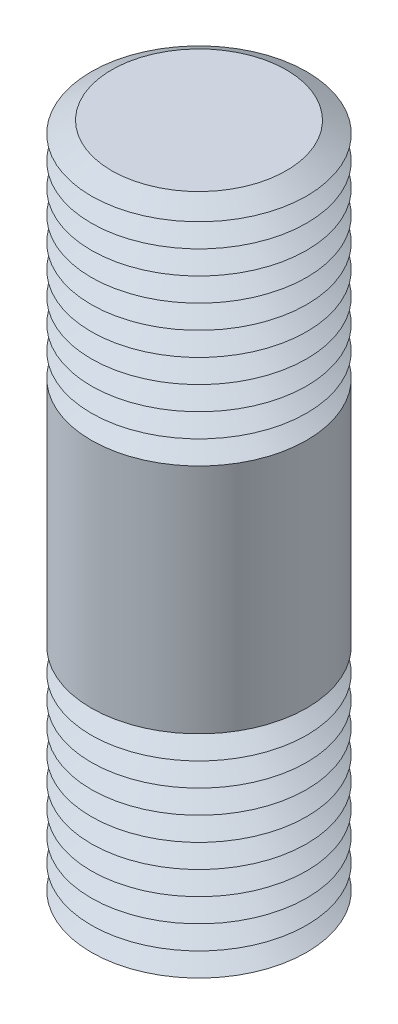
ISO-10303-21;
HEADER;
FILE_DESCRIPTION(('STEP AP214'),'2;1');
FILE_NAME('part.step','',(''),(''),'','','');
FILE_SCHEMA(('AUTOMOTIVE_DESIGN { 1 0 10303 214 1 1 1 1 }'));
ENDSEC;
DATA;
#1=APPLICATION_CONTEXT('core data for automotive mechanical design processes');
#2=APPLICATION_PROTOCOL_DEFINITION('international standard','automotive_design',2000,#1);
#3=PRODUCT_CONTEXT('',#1,'mechanical');
#4=PRODUCT('Part','Part','',(#3));
#5=PRODUCT_RELATED_PRODUCT_CATEGORY('part','',(#4));
#6=PRODUCT_DEFINITION_FORMATION('','',#4);
#7=PRODUCT_DEFINITION_CONTEXT('part definition',#1,'design');
#8=PRODUCT_DEFINITION('design','',#6,#7);
#9=PRODUCT_DEFINITION_SHAPE('','',#8);
#10=(LENGTH_UNIT() NAMED_UNIT(*) SI_UNIT(.MILLI.,.METRE.));
#11=(NAMED_UNIT(*) PLANE_ANGLE_UNIT() SI_UNIT($,.RADIAN.));
#12=(NAMED_UNIT(*) SI_UNIT($,.STERADIAN.) SOLID_ANGLE_UNIT());
#13=UNCERTAINTY_MEASURE_WITH_UNIT(LENGTH_MEASURE(1.E-05),#10,'distance_accuracy_value','');
#14=(GEOMETRIC_REPRESENTATION_CONTEXT(3) GLOBAL_UNCERTAINTY_ASSIGNED_CONTEXT((#13)) GLOBAL_UNIT_ASSIGNED_CONTEXT((#10,
#11,#12)) REPRESENTATION_CONTEXT('',''));
#15=CARTESIAN_POINT('',(0.,0.,0.));
#16=DIRECTION('',(0.,0.,1.));
#17=DIRECTION('',(1.,0.,0.));
#18=AXIS2_PLACEMENT_3D('',#15,#16,#17);
#19=CARTESIAN_POINT('',(0.,-2.96845218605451,0.));
#20=DIRECTION('',(0.,-1.,0.));
#21=DIRECTION('',(0.,0.,-1.));
#22=AXIS2_PLACEMENT_3D('',#19,#20,#21);
#23=CYLINDRICAL_SURFACE('',#22,6.35000000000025);
#24=CARTESIAN_POINT('',(0.,6.8364138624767,0.));
#25=DIRECTION('',(0.,-1.,0.));
#26=DIRECTION('',(0.,0.,-1.));
#27=AXIS2_PLACEMENT_3D('',#24,#25,#26);
#28=CIRCLE('',#27,6.35000000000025);
#29=CARTESIAN_POINT('',(0.,6.8364138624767,-6.35000000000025));
#30=VERTEX_POINT('',#29);
#31=EDGE_CURVE('E10',#30,#30,#28,.T.);
#32=ORIENTED_EDGE('',*,*,#31,.T.);
#33=EDGE_LOOP('',(#32));
#34=FACE_BOUND('',#33,.T.);
#35=CARTESIAN_POINT('',(0.,-6.8364138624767,0.));
#36=DIRECTION('',(0.,-1.,0.));
#37=DIRECTION('',(0.,0.,-1.));
#38=AXIS2_PLACEMENT_3D('',#35,#36,#37);
#39=CIRCLE('',#38,6.35000000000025);
#40=CARTESIAN_POINT('',(0.,-6.8364138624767,-6.35000000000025));
#41=VERTEX_POINT('',#40);
#42=EDGE_CURVE('E98',#41,#41,#39,.T.);
#43=ORIENTED_EDGE('',*,*,#42,.F.);
#44=EDGE_LOOP('',(#43));
#45=FACE_BOUND('',#44,.T.);
#46=ADVANCED_FACE('F31',(#34,#45),#23,.T.);
#47=CARTESIAN_POINT('',(0.,6.8364138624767,0.));
#48=DIRECTION('',(0.,-1.,0.));
#49=DIRECTION('',(0.,0.,-1.));
#50=AXIS2_PLACEMENT_3D('',#47,#48,#49);
#51=CONICAL_SURFACE('',#50,6.35000000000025,1.04719755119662);
#52=CARTESIAN_POINT('',(0.,7.5292341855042,0.));
#53=DIRECTION('',(0.,-1.,0.));
#54=DIRECTION('',(0.,0.,-1.));
#55=AXIS2_PLACEMENT_3D('',#52,#53,#54);
#56=CIRCLE('',#55,5.15000000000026);
#57=CARTESIAN_POINT('',(0.,7.5292341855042,-5.15000000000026));
#58=VERTEX_POINT('',#57);
#59=EDGE_CURVE('E37',#58,#58,#56,.T.);
#60=ORIENTED_EDGE('',*,*,#59,.T.);
#61=EDGE_LOOP('',(#60));
#62=FACE_BOUND('',#61,.T.);
#63=ORIENTED_EDGE('',*,*,#31,.F.);
#64=EDGE_LOOP('',(#63));
#65=FACE_BOUND('',#64,.T.);
#66=ADVANCED_FACE('F277',(#62,#65),#51,.T.);
#67=CARTESIAN_POINT('',(0.,7.5292341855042,0.));
#68=DIRECTION('',(0.,1.,0.));
#69=DIRECTION('',(0.,0.,1.));
#70=AXIS2_PLACEMENT_3D('',#67,#68,#69);
#71=CONICAL_SURFACE('',#70,5.15000000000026,1.04719755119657);
#72=CARTESIAN_POINT('',(0.,8.22205450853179,0.));
#73=DIRECTION('',(0.,-1.,0.));
#74=DIRECTION('',(0.,0.,-1.));
#75=AXIS2_PLACEMENT_3D('',#72,#73,#74);
#76=CIRCLE('',#75,6.35000000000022);
#77=CARTESIAN_POINT('',(0.,8.22205450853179,-6.35000000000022));
#78=VERTEX_POINT('',#77);
#79=EDGE_CURVE('E41',#78,#78,#76,.T.);
#80=ORIENTED_EDGE('',*,*,#79,.T.);
#81=EDGE_LOOP('',(#80));
#82=FACE_BOUND('',#81,.T.);
#83=ORIENTED_EDGE('',*,*,#59,.F.);
#84=EDGE_LOOP('',(#83));
#85=FACE_BOUND('',#84,.T.);
#86=ADVANCED_FACE('F281',(#82,#85),#71,.T.);
#87=CARTESIAN_POINT('',(0.,8.22205450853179,0.));
#88=DIRECTION('',(0.,-1.,0.));
#89=DIRECTION('',(0.,0.,-1.));
#90=AXIS2_PLACEMENT_3D('',#87,#88,#89);
#91=CONICAL_SURFACE('',#90,6.35000000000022,1.04719755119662);
#92=CARTESIAN_POINT('',(0.,8.91487483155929,0.));
#93=DIRECTION('',(0.,-1.,0.));
#94=DIRECTION('',(0.,0.,-1.));
#95=AXIS2_PLACEMENT_3D('',#92,#93,#94);
#96=CIRCLE('',#95,5.15000000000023);
#97=CARTESIAN_POINT('',(0.,8.91487483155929,-5.15000000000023));
#98=VERTEX_POINT('',#97);
#99=EDGE_CURVE('E45',#98,#98,#96,.T.);
#100=ORIENTED_EDGE('',*,*,#99,.T.);
#101=EDGE_LOOP('',(#100));
#102=FACE_BOUND('',#101,.T.);
#103=ORIENTED_EDGE('',*,*,#79,.F.);
#104=EDGE_LOOP('',(#103));
#105=FACE_BOUND('',#104,.T.);
#106=ADVANCED_FACE('F285',(#102,#105),#91,.T.);
#107=CARTESIAN_POINT('',(0.,8.91487483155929,0.));
#108=DIRECTION('',(0.,1.,0.));
#109=DIRECTION('',(0.,0.,1.));
#110=AXIS2_PLACEMENT_3D('',#107,#108,#109);
#111=CONICAL_SURFACE('',#110,5.15000000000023,1.04719755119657);
#112=CARTESIAN_POINT('',(0.,9.60769515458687,0.));
#113=DIRECTION('',(0.,-1.,0.));
#114=DIRECTION('',(0.,0.,-1.));
#115=AXIS2_PLACEMENT_3D('',#112,#113,#114);
#116=CIRCLE('',#115,6.3500000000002);
#117=CARTESIAN_POINT('',(0.,9.60769515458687,-6.3500000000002));
#118=VERTEX_POINT('',#117);
#119=EDGE_CURVE('E50',#118,#118,#116,.T.);
#120=ORIENTED_EDGE('',*,*,#119,.T.);
#121=EDGE_LOOP('',(#120));
#122=FACE_BOUND('',#121,.T.);
#123=ORIENTED_EDGE('',*,*,#99,.F.);
#124=EDGE_LOOP('',(#123));
#125=FACE_BOUND('',#124,.T.);
#126=ADVANCED_FACE('F292',(#122,#125),#111,.T.);
#127=CARTESIAN_POINT('',(0.,9.60769515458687,0.));
#128=DIRECTION('',(0.,-1.,0.));
#129=DIRECTION('',(0.,0.,-1.));
#130=AXIS2_PLACEMENT_3D('',#127,#128,#129);
#131=CONICAL_SURFACE('',#130,6.3500000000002,1.04719755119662);
#132=CARTESIAN_POINT('',(0.,10.3005154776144,0.));
#133=DIRECTION('',(0.,-1.,0.));
#134=DIRECTION('',(0.,0.,-1.));
#135=AXIS2_PLACEMENT_3D('',#132,#133,#134);
#136=CIRCLE('',#135,5.1500000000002);
#137=CARTESIAN_POINT('',(0.,10.3005154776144,-5.1500000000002));
#138=VERTEX_POINT('',#137);
#139=EDGE_CURVE('E53',#138,#138,#136,.T.);
#140=ORIENTED_EDGE('',*,*,#139,.T.);
#141=EDGE_LOOP('',(#140));
#142=FACE_BOUND('',#141,.T.);
#143=ORIENTED_EDGE('',*,*,#119,.F.);
#144=EDGE_LOOP('',(#143));
#145=FACE_BOUND('',#144,.T.);
#146=ADVANCED_FACE('F296',(#142,#145),#131,.T.);
#147=CARTESIAN_POINT('',(0.,10.3005154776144,0.));
#148=DIRECTION('',(0.,1.,0.));
#149=DIRECTION('',(0.,0.,1.));
#150=AXIS2_PLACEMENT_3D('',#147,#148,#149);
#151=CONICAL_SURFACE('',#150,5.1500000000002,1.04719755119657);
#152=CARTESIAN_POINT('',(0.,10.993335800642,0.));
#153=DIRECTION('',(0.,-1.,0.));
#154=DIRECTION('',(0.,0.,-1.));
#155=AXIS2_PLACEMENT_3D('',#152,#153,#154);
#156=CIRCLE('',#155,6.35000000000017);
#157=CARTESIAN_POINT('',(0.,10.993335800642,-6.35000000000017));
#158=VERTEX_POINT('',#157);
#159=EDGE_CURVE('E56',#158,#158,#156,.T.);
#160=ORIENTED_EDGE('',*,*,#159,.T.);
#161=EDGE_LOOP('',(#160));
#162=FACE_BOUND('',#161,.T.);
#163=ORIENTED_EDGE('',*,*,#139,.F.);
#164=EDGE_LOOP('',(#163));
#165=FACE_BOUND('',#164,.T.);
#166=ADVANCED_FACE('F300',(#162,#165),#151,.T.);
#167=CARTESIAN_POINT('',(0.,10.993335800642,0.));
#168=DIRECTION('',(0.,-1.,0.));
#169=DIRECTION('',(0.,0.,-1.));
#170=AXIS2_PLACEMENT_3D('',#167,#168,#169);
#171=CONICAL_SURFACE('',#170,6.35000000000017,1.04719755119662);
#172=CARTESIAN_POINT('',(0.,11.6861561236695,0.));
#173=DIRECTION('',(0.,-1.,0.));
#174=DIRECTION('',(0.,0.,-1.));
#175=AXIS2_PLACEMENT_3D('',#172,#173,#174);
#176=CIRCLE('',#175,5.15000000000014);
#177=CARTESIAN_POINT('',(0.,11.6861561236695,-5.15000000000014));
#178=VERTEX_POINT('',#177);
#179=EDGE_CURVE('E59',#178,#178,#176,.T.);
#180=ORIENTED_EDGE('',*,*,#179,.T.);
#181=EDGE_LOOP('',(#180));
#182=FACE_BOUND('',#181,.T.);
#183=ORIENTED_EDGE('',*,*,#159,.F.);
#184=EDGE_LOOP('',(#183));
#185=FACE_BOUND('',#184,.T.);
#186=ADVANCED_FACE('F304',(#182,#185),#171,.T.);
#187=CARTESIAN_POINT('',(0.,11.6861561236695,0.));
#188=DIRECTION('',(0.,1.,0.));
#189=DIRECTION('',(0.,0.,1.));
#190=AXIS2_PLACEMENT_3D('',#187,#188,#189);
#191=CONICAL_SURFACE('',#190,5.15000000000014,1.04719755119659);
#192=CARTESIAN_POINT('',(0.,12.3789764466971,0.));
#193=DIRECTION('',(0.,-1.,0.));
#194=DIRECTION('',(0.,0.,-1.));
#195=AXIS2_PLACEMENT_3D('',#192,#193,#194);
#196=CIRCLE('',#195,6.35000000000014);
#197=CARTESIAN_POINT('',(0.,12.3789764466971,-6.35000000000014));
#198=VERTEX_POINT('',#197);
#199=EDGE_CURVE('E62',#198,#198,#196,.T.);
#200=ORIENTED_EDGE('',*,*,#199,.T.);
#201=EDGE_LOOP('',(#200));
#202=FACE_BOUND('',#201,.T.);
#203=ORIENTED_EDGE('',*,*,#179,.F.);
#204=EDGE_LOOP('',(#203));
#205=FACE_BOUND('',#204,.T.);
#206=ADVANCED_FACE('F308',(#202,#205),#191,.T.);
#207=CARTESIAN_POINT('',(0.,12.3789764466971,0.));
#208=DIRECTION('',(0.,-1.,0.));
#209=DIRECTION('',(0.,0.,-1.));
#210=AXIS2_PLACEMENT_3D('',#207,#208,#209);
#211=CONICAL_SURFACE('',#210,6.35000000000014,1.04719755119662);
#212=CARTESIAN_POINT('',(0.,13.0717967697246,0.));
#213=DIRECTION('',(0.,-1.,0.));
#214=DIRECTION('',(0.,0.,-1.));
#215=AXIS2_PLACEMENT_3D('',#212,#213,#214);
#216=CIRCLE('',#215,5.15000000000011);
#217=CARTESIAN_POINT('',(0.,13.0717967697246,-5.15000000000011));
#218=VERTEX_POINT('',#217);
#219=EDGE_CURVE('E65',#218,#218,#216,.T.);
#220=ORIENTED_EDGE('',*,*,#219,.T.);
#221=EDGE_LOOP('',(#220));
#222=FACE_BOUND('',#221,.T.);
#223=ORIENTED_EDGE('',*,*,#199,.F.);
#224=EDGE_LOOP('',(#223));
#225=FACE_BOUND('',#224,.T.);
#226=ADVANCED_FACE('F312',(#222,#225),#211,.T.);
#227=CARTESIAN_POINT('',(0.,13.0717967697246,0.));
#228=DIRECTION('',(0.,1.,0.));
#229=DIRECTION('',(0.,0.,1.));
#230=AXIS2_PLACEMENT_3D('',#227,#228,#229);
#231=CONICAL_SURFACE('',#230,5.15000000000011,1.04719755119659);
#232=CARTESIAN_POINT('',(0.,13.7646170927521,0.));
#233=DIRECTION('',(0.,-1.,0.));
#234=DIRECTION('',(0.,0.,-1.));
#235=AXIS2_PLACEMENT_3D('',#232,#233,#234);
#236=CIRCLE('',#235,6.35000000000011);
#237=CARTESIAN_POINT('',(0.,13.7646170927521,-6.35000000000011));
#238=VERTEX_POINT('',#237);
#239=EDGE_CURVE('E68',#238,#238,#236,.T.);
#240=ORIENTED_EDGE('',*,*,#239,.T.);
#241=EDGE_LOOP('',(#240));
#242=FACE_BOUND('',#241,.T.);
#243=ORIENTED_EDGE('',*,*,#219,.F.);
#244=EDGE_LOOP('',(#243));
#245=FACE_BOUND('',#244,.T.);
#246=ADVANCED_FACE('F316',(#242,#245),#231,.T.);
#247=CARTESIAN_POINT('',(0.,13.7646170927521,0.));
#248=DIRECTION('',(0.,-1.,0.));
#249=DIRECTION('',(0.,0.,-1.));
#250=AXIS2_PLACEMENT_3D('',#247,#248,#249);
#251=CONICAL_SURFACE('',#250,6.35000000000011,1.04719755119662);
#252=CARTESIAN_POINT('',(0.,14.4574374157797,0.));
#253=DIRECTION('',(0.,-1.,0.));
#254=DIRECTION('',(0.,0.,-1.));
#255=AXIS2_PLACEMENT_3D('',#252,#253,#254);
#256=CIRCLE('',#255,5.15000000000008);
#257=CARTESIAN_POINT('',(0.,14.4574374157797,-5.15000000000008));
#258=VERTEX_POINT('',#257);
#259=EDGE_CURVE('E71',#258,#258,#256,.T.);
#260=ORIENTED_EDGE('',*,*,#259,.T.);
#261=EDGE_LOOP('',(#260));
#262=FACE_BOUND('',#261,.T.);
#263=ORIENTED_EDGE('',*,*,#239,.F.);
#264=EDGE_LOOP('',(#263));
#265=FACE_BOUND('',#264,.T.);
#266=ADVANCED_FACE('F320',(#262,#265),#251,.T.);
#267=CARTESIAN_POINT('',(0.,14.4574374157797,0.));
#268=DIRECTION('',(0.,1.,0.));
#269=DIRECTION('',(0.,0.,1.));
#270=AXIS2_PLACEMENT_3D('',#267,#268,#269);
#271=CONICAL_SURFACE('',#270,5.15000000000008,1.04719755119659);
#272=CARTESIAN_POINT('',(0.,15.1502577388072,0.));
#273=DIRECTION('',(0.,-1.,0.));
#274=DIRECTION('',(0.,0.,-1.));
#275=AXIS2_PLACEMENT_3D('',#272,#273,#274);
#276=CIRCLE('',#275,6.35000000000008);
#277=CARTESIAN_POINT('',(0.,15.1502577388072,-6.35000000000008));
#278=VERTEX_POINT('',#277);
#279=EDGE_CURVE('E74',#278,#278,#276,.T.);
#280=ORIENTED_EDGE('',*,*,#279,.T.);
#281=EDGE_LOOP('',(#280));
#282=FACE_BOUND('',#281,.T.);
#283=ORIENTED_EDGE('',*,*,#259,.F.);
#284=EDGE_LOOP('',(#283));
#285=FACE_BOUND('',#284,.T.);
#286=ADVANCED_FACE('F324',(#282,#285),#271,.T.);
#287=CARTESIAN_POINT('',(0.,15.1502577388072,0.));
#288=DIRECTION('',(0.,-1.,0.));
#289=DIRECTION('',(0.,0.,-1.));
#290=AXIS2_PLACEMENT_3D('',#287,#288,#289);
#291=CONICAL_SURFACE('',#290,6.35000000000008,1.04719755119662);
#292=CARTESIAN_POINT('',(0.,15.8430780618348,0.));
#293=DIRECTION('',(0.,-1.,0.));
#294=DIRECTION('',(0.,0.,-1.));
#295=AXIS2_PLACEMENT_3D('',#292,#293,#294);
#296=CIRCLE('',#295,5.15000000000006);
#297=CARTESIAN_POINT('',(0.,15.8430780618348,-5.15000000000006));
#298=VERTEX_POINT('',#297);
#299=EDGE_CURVE('E77',#298,#298,#296,.T.);
#300=ORIENTED_EDGE('',*,*,#299,.T.);
#301=EDGE_LOOP('',(#300));
#302=FACE_BOUND('',#301,.T.);
#303=ORIENTED_EDGE('',*,*,#279,.F.);
#304=EDGE_LOOP('',(#303));
#305=FACE_BOUND('',#304,.T.);
#306=ADVANCED_FACE('F328',(#302,#305),#291,.T.);
#307=CARTESIAN_POINT('',(0.,15.8430780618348,0.));
#308=DIRECTION('',(0.,1.,0.));
#309=DIRECTION('',(0.,0.,1.));
#310=AXIS2_PLACEMENT_3D('',#307,#308,#309);
#311=CONICAL_SURFACE('',#310,5.15000000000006,1.04719755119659);
#312=CARTESIAN_POINT('',(0.,16.5358983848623,0.));
#313=DIRECTION('',(0.,-1.,0.));
#314=DIRECTION('',(0.,0.,-1.));
#315=AXIS2_PLACEMENT_3D('',#312,#313,#314);
#316=CIRCLE('',#315,6.35000000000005);
#317=CARTESIAN_POINT('',(0.,16.5358983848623,-6.35000000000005));
#318=VERTEX_POINT('',#317);
#319=EDGE_CURVE('E80',#318,#318,#316,.T.);
#320=ORIENTED_EDGE('',*,*,#319,.T.);
#321=EDGE_LOOP('',(#320));
#322=FACE_BOUND('',#321,.T.);
#323=ORIENTED_EDGE('',*,*,#299,.F.);
#324=EDGE_LOOP('',(#323));
#325=FACE_BOUND('',#324,.T.);
#326=ADVANCED_FACE('F332',(#322,#325),#311,.T.);
#327=CARTESIAN_POINT('',(0.,16.5358983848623,0.));
#328=DIRECTION('',(0.,-1.,0.));
#329=DIRECTION('',(0.,0.,-1.));
#330=AXIS2_PLACEMENT_3D('',#327,#328,#329);
#331=CONICAL_SURFACE('',#330,6.35000000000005,1.04719755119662);
#332=CARTESIAN_POINT('',(0.,17.2287187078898,0.));
#333=DIRECTION('',(0.,-1.,0.));
#334=DIRECTION('',(0.,0.,-1.));
#335=AXIS2_PLACEMENT_3D('',#332,#333,#334);
#336=CIRCLE('',#335,5.15000000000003);
#337=CARTESIAN_POINT('',(0.,17.2287187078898,-5.15000000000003));
#338=VERTEX_POINT('',#337);
#339=EDGE_CURVE('E83',#338,#338,#336,.T.);
#340=ORIENTED_EDGE('',*,*,#339,.T.);
#341=EDGE_LOOP('',(#340));
#342=FACE_BOUND('',#341,.T.);
#343=ORIENTED_EDGE('',*,*,#319,.F.);
#344=EDGE_LOOP('',(#343));
#345=FACE_BOUND('',#344,.T.);
#346=ADVANCED_FACE('F336',(#342,#345),#331,.T.);
#347=CARTESIAN_POINT('',(0.,17.2287187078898,0.));
#348=DIRECTION('',(0.,1.,0.));
#349=DIRECTION('',(0.,0.,1.));
#350=AXIS2_PLACEMENT_3D('',#347,#348,#349);
#351=CONICAL_SURFACE('',#350,5.15000000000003,1.04719755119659);
#352=CARTESIAN_POINT('',(0.,17.9215390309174,0.));
#353=DIRECTION('',(0.,-1.,0.));
#354=DIRECTION('',(0.,0.,-1.));
#355=AXIS2_PLACEMENT_3D('',#352,#353,#354);
#356=CIRCLE('',#355,6.35000000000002);
#357=CARTESIAN_POINT('',(0.,17.9215390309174,-6.35000000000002));
#358=VERTEX_POINT('',#357);
#359=EDGE_CURVE('E86',#358,#358,#356,.T.);
#360=ORIENTED_EDGE('',*,*,#359,.T.);
#361=EDGE_LOOP('',(#360));
#362=FACE_BOUND('',#361,.T.);
#363=ORIENTED_EDGE('',*,*,#339,.F.);
#364=EDGE_LOOP('',(#363));
#365=FACE_BOUND('',#364,.T.);
#366=ADVANCED_FACE('F340',(#362,#365),#351,.T.);
#367=CARTESIAN_POINT('',(0.,17.9215390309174,0.));
#368=DIRECTION('',(0.,-1.,0.));
#369=DIRECTION('',(0.,0.,-1.));
#370=AXIS2_PLACEMENT_3D('',#367,#368,#369);
#371=CONICAL_SURFACE('',#370,6.35000000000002,1.04719755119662);
#372=CARTESIAN_POINT('',(0.,18.6143593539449,0.));
#373=DIRECTION('',(0.,-1.,0.));
#374=DIRECTION('',(0.,0.,-1.));
#375=AXIS2_PLACEMENT_3D('',#372,#373,#374);
#376=CIRCLE('',#375,5.15);
#377=CARTESIAN_POINT('',(0.,18.6143593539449,-5.15));
#378=VERTEX_POINT('',#377);
#379=EDGE_CURVE('E89',#378,#378,#376,.T.);
#380=ORIENTED_EDGE('',*,*,#379,.T.);
#381=EDGE_LOOP('',(#380));
#382=FACE_BOUND('',#381,.T.);
#383=ORIENTED_EDGE('',*,*,#359,.F.);
#384=EDGE_LOOP('',(#383));
#385=FACE_BOUND('',#384,.T.);
#386=ADVANCED_FACE('F344',(#382,#385),#371,.T.);
#387=CARTESIAN_POINT('',(0.,18.6143593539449,0.));
#388=DIRECTION('',(0.,1.,0.));
#389=DIRECTION('',(0.,0.,1.));
#390=AXIS2_PLACEMENT_3D('',#387,#388,#389);
#391=CONICAL_SURFACE('',#390,5.15,1.04719755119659);
#392=CARTESIAN_POINT('',(0.,19.3071796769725,0.));
#393=DIRECTION('',(0.,-1.,0.));
#394=DIRECTION('',(0.,0.,-1.));
#395=AXIS2_PLACEMENT_3D('',#392,#393,#394);
#396=CIRCLE('',#395,6.35);
#397=CARTESIAN_POINT('',(0.,19.3071796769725,-6.35));
#398=VERTEX_POINT('',#397);
#399=EDGE_CURVE('E92',#398,#398,#396,.T.);
#400=ORIENTED_EDGE('',*,*,#399,.T.);
#401=EDGE_LOOP('',(#400));
#402=FACE_BOUND('',#401,.T.);
#403=ORIENTED_EDGE('',*,*,#379,.F.);
#404=EDGE_LOOP('',(#403));
#405=FACE_BOUND('',#404,.T.);
#406=ADVANCED_FACE('F348',(#402,#405),#391,.T.);
#407=CARTESIAN_POINT('',(0.,19.3071796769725,0.));
#408=DIRECTION('',(0.,-1.,0.));
#409=DIRECTION('',(0.,0.,-1.));
#410=AXIS2_PLACEMENT_3D('',#407,#408,#409);
#411=CONICAL_SURFACE('',#410,6.35,1.04719755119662);
#412=CARTESIAN_POINT('',(0.,20.,0.));
#413=DIRECTION('',(0.,-1.,0.));
#414=DIRECTION('',(0.,0.,-1.));
#415=AXIS2_PLACEMENT_3D('',#412,#413,#414);
#416=CIRCLE('',#415,5.15);
#417=CARTESIAN_POINT('',(0.,20.,-5.15));
#418=VERTEX_POINT('',#417);
#419=EDGE_CURVE('E95',#418,#418,#416,.T.);
#420=ORIENTED_EDGE('',*,*,#419,.T.);
#421=EDGE_LOOP('',(#420));
#422=FACE_BOUND('',#421,.T.);
#423=ORIENTED_EDGE('',*,*,#399,.F.);
#424=EDGE_LOOP('',(#423));
#425=FACE_BOUND('',#424,.T.);
#426=ADVANCED_FACE('F352',(#422,#425),#411,.T.);
#427=CARTESIAN_POINT('',(0.,20.,0.));
#428=DIRECTION('',(0.,1.,0.));
#429=DIRECTION('',(0.,0.,1.));
#430=AXIS2_PLACEMENT_3D('',#427,#428,#429);
#431=PLANE('',#430);
#432=ORIENTED_EDGE('',*,*,#419,.F.);
#433=EDGE_LOOP('',(#432));
#434=FACE_BOUND('',#433,.T.);
#435=ADVANCED_FACE('F272',(#434),#431,.T.);
#436=CARTESIAN_POINT('',(0.,-6.8364138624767,0.));
#437=DIRECTION('',(0.,1.,0.));
#438=DIRECTION('',(0.,0.,-1.));
#439=AXIS2_PLACEMENT_3D('',#436,#437,#438);
#440=CONICAL_SURFACE('',#439,6.35000000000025,1.04719755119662);
#441=CARTESIAN_POINT('',(0.,-7.5292341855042,0.));
#442=DIRECTION('',(0.,-1.,0.));
#443=DIRECTION('',(0.,0.,-1.));
#444=AXIS2_PLACEMENT_3D('',#441,#442,#443);
#445=CIRCLE('',#444,5.15000000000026);
#446=CARTESIAN_POINT('',(0.,-7.5292341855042,-5.15000000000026));
#447=VERTEX_POINT('',#446);
#448=EDGE_CURVE('E101',#447,#447,#445,.T.);
#449=ORIENTED_EDGE('',*,*,#448,.F.);
#450=EDGE_LOOP('',(#449));
#451=FACE_BOUND('',#450,.T.);
#452=ORIENTED_EDGE('',*,*,#42,.T.);
#453=EDGE_LOOP('',(#452));
#454=FACE_BOUND('',#453,.T.);
#455=ADVANCED_FACE('F266',(#451,#454),#440,.T.);
#456=CARTESIAN_POINT('',(0.,-7.5292341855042,0.));
#457=DIRECTION('',(0.,-1.,0.));
#458=DIRECTION('',(0.,0.,1.));
#459=AXIS2_PLACEMENT_3D('',#456,#457,#458);
#460=CONICAL_SURFACE('',#459,5.15000000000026,1.04719755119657);
#461=CARTESIAN_POINT('',(0.,-8.22205450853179,0.));
#462=DIRECTION('',(0.,-1.,0.));
#463=DIRECTION('',(0.,0.,-1.));
#464=AXIS2_PLACEMENT_3D('',#461,#462,#463);
#465=CIRCLE('',#464,6.35000000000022);
#466=CARTESIAN_POINT('',(0.,-8.22205450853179,-6.35000000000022));
#467=VERTEX_POINT('',#466);
#468=EDGE_CURVE('E104',#467,#467,#465,.T.);
#469=ORIENTED_EDGE('',*,*,#468,.F.);
#470=EDGE_LOOP('',(#469));
#471=FACE_BOUND('',#470,.T.);
#472=ORIENTED_EDGE('',*,*,#448,.T.);
#473=EDGE_LOOP('',(#472));
#474=FACE_BOUND('',#473,.T.);
#475=ADVANCED_FACE('F260',(#471,#474),#460,.T.);
#476=CARTESIAN_POINT('',(0.,-8.22205450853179,0.));
#477=DIRECTION('',(0.,1.,0.));
#478=DIRECTION('',(0.,0.,-1.));
#479=AXIS2_PLACEMENT_3D('',#476,#477,#478);
#480=CONICAL_SURFACE('',#479,6.35000000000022,1.04719755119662);
#481=CARTESIAN_POINT('',(0.,-8.91487483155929,0.));
#482=DIRECTION('',(0.,-1.,0.));
#483=DIRECTION('',(0.,0.,-1.));
#484=AXIS2_PLACEMENT_3D('',#481,#482,#483);
#485=CIRCLE('',#484,5.15000000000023);
#486=CARTESIAN_POINT('',(0.,-8.91487483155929,-5.15000000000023));
#487=VERTEX_POINT('',#486);
#488=EDGE_CURVE('E107',#487,#487,#485,.T.);
#489=ORIENTED_EDGE('',*,*,#488,.F.);
#490=EDGE_LOOP('',(#489));
#491=FACE_BOUND('',#490,.T.);
#492=ORIENTED_EDGE('',*,*,#468,.T.);
#493=EDGE_LOOP('',(#492));
#494=FACE_BOUND('',#493,.T.);
#495=ADVANCED_FACE('F254',(#491,#494),#480,.T.);
#496=CARTESIAN_POINT('',(0.,-8.91487483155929,0.));
#497=DIRECTION('',(0.,-1.,0.));
#498=DIRECTION('',(0.,0.,1.));
#499=AXIS2_PLACEMENT_3D('',#496,#497,#498);
#500=CONICAL_SURFACE('',#499,5.15000000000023,1.04719755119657);
#501=CARTESIAN_POINT('',(0.,-9.60769515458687,0.));
#502=DIRECTION('',(0.,-1.,0.));
#503=DIRECTION('',(0.,0.,-1.));
#504=AXIS2_PLACEMENT_3D('',#501,#502,#503);
#505=CIRCLE('',#504,6.3500000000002);
#506=CARTESIAN_POINT('',(0.,-9.60769515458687,-6.3500000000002));
#507=VERTEX_POINT('',#506);
#508=EDGE_CURVE('E110',#507,#507,#505,.T.);
#509=ORIENTED_EDGE('',*,*,#508,.F.);
#510=EDGE_LOOP('',(#509));
#511=FACE_BOUND('',#510,.T.);
#512=ORIENTED_EDGE('',*,*,#488,.T.);
#513=EDGE_LOOP('',(#512));
#514=FACE_BOUND('',#513,.T.);
#515=ADVANCED_FACE('F248',(#511,#514),#500,.T.);
#516=CARTESIAN_POINT('',(0.,-9.60769515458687,0.));
#517=DIRECTION('',(0.,1.,0.));
#518=DIRECTION('',(0.,0.,-1.));
#519=AXIS2_PLACEMENT_3D('',#516,#517,#518);
#520=CONICAL_SURFACE('',#519,6.3500000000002,1.04719755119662);
#521=CARTESIAN_POINT('',(0.,-10.3005154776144,0.));
#522=DIRECTION('',(0.,-1.,0.));
#523=DIRECTION('',(0.,0.,-1.));
#524=AXIS2_PLACEMENT_3D('',#521,#522,#523);
#525=CIRCLE('',#524,5.1500000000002);
#526=CARTESIAN_POINT('',(0.,-10.3005154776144,-5.1500000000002));
#527=VERTEX_POINT('',#526);
#528=EDGE_CURVE('E113',#527,#527,#525,.T.);
#529=ORIENTED_EDGE('',*,*,#528,.F.);
#530=EDGE_LOOP('',(#529));
#531=FACE_BOUND('',#530,.T.);
#532=ORIENTED_EDGE('',*,*,#508,.T.);
#533=EDGE_LOOP('',(#532));
#534=FACE_BOUND('',#533,.T.);
#535=ADVANCED_FACE('F242',(#531,#534),#520,.T.);
#536=CARTESIAN_POINT('',(0.,-10.3005154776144,0.));
#537=DIRECTION('',(0.,-1.,0.));
#538=DIRECTION('',(0.,0.,1.));
#539=AXIS2_PLACEMENT_3D('',#536,#537,#538);
#540=CONICAL_SURFACE('',#539,5.1500000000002,1.04719755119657);
#541=CARTESIAN_POINT('',(0.,-10.993335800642,0.));
#542=DIRECTION('',(0.,-1.,0.));
#543=DIRECTION('',(0.,0.,-1.));
#544=AXIS2_PLACEMENT_3D('',#541,#542,#543);
#545=CIRCLE('',#544,6.35000000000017);
#546=CARTESIAN_POINT('',(0.,-10.993335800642,-6.35000000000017));
#547=VERTEX_POINT('',#546);
#548=EDGE_CURVE('E116',#547,#547,#545,.T.);
#549=ORIENTED_EDGE('',*,*,#548,.F.);
#550=EDGE_LOOP('',(#549));
#551=FACE_BOUND('',#550,.T.);
#552=ORIENTED_EDGE('',*,*,#528,.T.);
#553=EDGE_LOOP('',(#552));
#554=FACE_BOUND('',#553,.T.);
#555=ADVANCED_FACE('F236',(#551,#554),#540,.T.);
#556=CARTESIAN_POINT('',(0.,-10.993335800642,0.));
#557=DIRECTION('',(0.,1.,0.));
#558=DIRECTION('',(0.,0.,-1.));
#559=AXIS2_PLACEMENT_3D('',#556,#557,#558);
#560=CONICAL_SURFACE('',#559,6.35000000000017,1.04719755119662);
#561=CARTESIAN_POINT('',(0.,-11.6861561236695,0.));
#562=DIRECTION('',(0.,-1.,0.));
#563=DIRECTION('',(0.,0.,-1.));
#564=AXIS2_PLACEMENT_3D('',#561,#562,#563);
#565=CIRCLE('',#564,5.15000000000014);
#566=CARTESIAN_POINT('',(0.,-11.6861561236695,-5.15000000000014));
#567=VERTEX_POINT('',#566);
#568=EDGE_CURVE('E119',#567,#567,#565,.T.);
#569=ORIENTED_EDGE('',*,*,#568,.F.);
#570=EDGE_LOOP('',(#569));
#571=FACE_BOUND('',#570,.T.);
#572=ORIENTED_EDGE('',*,*,#548,.T.);
#573=EDGE_LOOP('',(#572));
#574=FACE_BOUND('',#573,.T.);
#575=ADVANCED_FACE('F230',(#571,#574),#560,.T.);
#576=CARTESIAN_POINT('',(0.,-11.6861561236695,0.));
#577=DIRECTION('',(0.,-1.,0.));
#578=DIRECTION('',(0.,0.,1.));
#579=AXIS2_PLACEMENT_3D('',#576,#577,#578);
#580=CONICAL_SURFACE('',#579,5.15000000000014,1.04719755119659);
#581=CARTESIAN_POINT('',(0.,-12.3789764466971,0.));
#582=DIRECTION('',(0.,-1.,0.));
#583=DIRECTION('',(0.,0.,-1.));
#584=AXIS2_PLACEMENT_3D('',#581,#582,#583);
#585=CIRCLE('',#584,6.35000000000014);
#586=CARTESIAN_POINT('',(0.,-12.3789764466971,-6.35000000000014));
#587=VERTEX_POINT('',#586);
#588=EDGE_CURVE('E122',#587,#587,#585,.T.);
#589=ORIENTED_EDGE('',*,*,#588,.F.);
#590=EDGE_LOOP('',(#589));
#591=FACE_BOUND('',#590,.T.);
#592=ORIENTED_EDGE('',*,*,#568,.T.);
#593=EDGE_LOOP('',(#592));
#594=FACE_BOUND('',#593,.T.);
#595=ADVANCED_FACE('F224',(#591,#594),#580,.T.);
#596=CARTESIAN_POINT('',(0.,-12.3789764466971,0.));
#597=DIRECTION('',(0.,1.,0.));
#598=DIRECTION('',(0.,0.,-1.));
#599=AXIS2_PLACEMENT_3D('',#596,#597,#598);
#600=CONICAL_SURFACE('',#599,6.35000000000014,1.04719755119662);
#601=CARTESIAN_POINT('',(0.,-13.0717967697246,0.));
#602=DIRECTION('',(0.,-1.,0.));
#603=DIRECTION('',(0.,0.,-1.));
#604=AXIS2_PLACEMENT_3D('',#601,#602,#603);
#605=CIRCLE('',#604,5.15000000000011);
#606=CARTESIAN_POINT('',(0.,-13.0717967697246,-5.15000000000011));
#607=VERTEX_POINT('',#606);
#608=EDGE_CURVE('E125',#607,#607,#605,.T.);
#609=ORIENTED_EDGE('',*,*,#608,.F.);
#610=EDGE_LOOP('',(#609));
#611=FACE_BOUND('',#610,.T.);
#612=ORIENTED_EDGE('',*,*,#588,.T.);
#613=EDGE_LOOP('',(#612));
#614=FACE_BOUND('',#613,.T.);
#615=ADVANCED_FACE('F218',(#611,#614),#600,.T.);
#616=CARTESIAN_POINT('',(0.,-13.0717967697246,0.));
#617=DIRECTION('',(0.,-1.,0.));
#618=DIRECTION('',(0.,0.,1.));
#619=AXIS2_PLACEMENT_3D('',#616,#617,#618);
#620=CONICAL_SURFACE('',#619,5.15000000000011,1.04719755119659);
#621=CARTESIAN_POINT('',(0.,-13.7646170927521,0.));
#622=DIRECTION('',(0.,-1.,0.));
#623=DIRECTION('',(0.,0.,-1.));
#624=AXIS2_PLACEMENT_3D('',#621,#622,#623);
#625=CIRCLE('',#624,6.35000000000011);
#626=CARTESIAN_POINT('',(0.,-13.7646170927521,-6.35000000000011));
#627=VERTEX_POINT('',#626);
#628=EDGE_CURVE('E128',#627,#627,#625,.T.);
#629=ORIENTED_EDGE('',*,*,#628,.F.);
#630=EDGE_LOOP('',(#629));
#631=FACE_BOUND('',#630,.T.);
#632=ORIENTED_EDGE('',*,*,#608,.T.);
#633=EDGE_LOOP('',(#632));
#634=FACE_BOUND('',#633,.T.);
#635=ADVANCED_FACE('F212',(#631,#634),#620,.T.);
#636=CARTESIAN_POINT('',(0.,-13.7646170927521,0.));
#637=DIRECTION('',(0.,1.,0.));
#638=DIRECTION('',(0.,0.,-1.));
#639=AXIS2_PLACEMENT_3D('',#636,#637,#638);
#640=CONICAL_SURFACE('',#639,6.35000000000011,1.04719755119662);
#641=CARTESIAN_POINT('',(0.,-14.4574374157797,0.));
#642=DIRECTION('',(0.,-1.,0.));
#643=DIRECTION('',(0.,0.,-1.));
#644=AXIS2_PLACEMENT_3D('',#641,#642,#643);
#645=CIRCLE('',#644,5.15000000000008);
#646=CARTESIAN_POINT('',(0.,-14.4574374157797,-5.15000000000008));
#647=VERTEX_POINT('',#646);
#648=EDGE_CURVE('E131',#647,#647,#645,.T.);
#649=ORIENTED_EDGE('',*,*,#648,.F.);
#650=EDGE_LOOP('',(#649));
#651=FACE_BOUND('',#650,.T.);
#652=ORIENTED_EDGE('',*,*,#628,.T.);
#653=EDGE_LOOP('',(#652));
#654=FACE_BOUND('',#653,.T.);
#655=ADVANCED_FACE('F206',(#651,#654),#640,.T.);
#656=CARTESIAN_POINT('',(0.,-14.4574374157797,0.));
#657=DIRECTION('',(0.,-1.,0.));
#658=DIRECTION('',(0.,0.,1.));
#659=AXIS2_PLACEMENT_3D('',#656,#657,#658);
#660=CONICAL_SURFACE('',#659,5.15000000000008,1.04719755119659);
#661=CARTESIAN_POINT('',(0.,-15.1502577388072,0.));
#662=DIRECTION('',(0.,-1.,0.));
#663=DIRECTION('',(0.,0.,-1.));
#664=AXIS2_PLACEMENT_3D('',#661,#662,#663);
#665=CIRCLE('',#664,6.35000000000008);
#666=CARTESIAN_POINT('',(0.,-15.1502577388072,-6.35000000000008));
#667=VERTEX_POINT('',#666);
#668=EDGE_CURVE('E134',#667,#667,#665,.T.);
#669=ORIENTED_EDGE('',*,*,#668,.F.);
#670=EDGE_LOOP('',(#669));
#671=FACE_BOUND('',#670,.T.);
#672=ORIENTED_EDGE('',*,*,#648,.T.);
#673=EDGE_LOOP('',(#672));
#674=FACE_BOUND('',#673,.T.);
#675=ADVANCED_FACE('F200',(#671,#674),#660,.T.);
#676=CARTESIAN_POINT('',(0.,-15.1502577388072,0.));
#677=DIRECTION('',(0.,1.,0.));
#678=DIRECTION('',(0.,0.,-1.));
#679=AXIS2_PLACEMENT_3D('',#676,#677,#678);
#680=CONICAL_SURFACE('',#679,6.35000000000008,1.04719755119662);
#681=CARTESIAN_POINT('',(0.,-15.8430780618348,0.));
#682=DIRECTION('',(0.,-1.,0.));
#683=DIRECTION('',(0.,0.,-1.));
#684=AXIS2_PLACEMENT_3D('',#681,#682,#683);
#685=CIRCLE('',#684,5.15000000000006);
#686=CARTESIAN_POINT('',(0.,-15.8430780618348,-5.15000000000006));
#687=VERTEX_POINT('',#686);
#688=EDGE_CURVE('E137',#687,#687,#685,.T.);
#689=ORIENTED_EDGE('',*,*,#688,.F.);
#690=EDGE_LOOP('',(#689));
#691=FACE_BOUND('',#690,.T.);
#692=ORIENTED_EDGE('',*,*,#668,.T.);
#693=EDGE_LOOP('',(#692));
#694=FACE_BOUND('',#693,.T.);
#695=ADVANCED_FACE('F194',(#691,#694),#680,.T.);
#696=CARTESIAN_POINT('',(0.,-15.8430780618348,0.));
#697=DIRECTION('',(0.,-1.,0.));
#698=DIRECTION('',(0.,0.,1.));
#699=AXIS2_PLACEMENT_3D('',#696,#697,#698);
#700=CONICAL_SURFACE('',#699,5.15000000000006,1.04719755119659);
#701=CARTESIAN_POINT('',(0.,-16.5358983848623,0.));
#702=DIRECTION('',(0.,-1.,0.));
#703=DIRECTION('',(0.,0.,-1.));
#704=AXIS2_PLACEMENT_3D('',#701,#702,#703);
#705=CIRCLE('',#704,6.35000000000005);
#706=CARTESIAN_POINT('',(0.,-16.5358983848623,-6.35000000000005));
#707=VERTEX_POINT('',#706);
#708=EDGE_CURVE('E140',#707,#707,#705,.T.);
#709=ORIENTED_EDGE('',*,*,#708,.F.);
#710=EDGE_LOOP('',(#709));
#711=FACE_BOUND('',#710,.T.);
#712=ORIENTED_EDGE('',*,*,#688,.T.);
#713=EDGE_LOOP('',(#712));
#714=FACE_BOUND('',#713,.T.);
#715=ADVANCED_FACE('F188',(#711,#714),#700,.T.);
#716=CARTESIAN_POINT('',(0.,-16.5358983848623,0.));
#717=DIRECTION('',(0.,1.,0.));
#718=DIRECTION('',(0.,0.,-1.));
#719=AXIS2_PLACEMENT_3D('',#716,#717,#718);
#720=CONICAL_SURFACE('',#719,6.35000000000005,1.04719755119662);
#721=CARTESIAN_POINT('',(0.,-17.2287187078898,0.));
#722=DIRECTION('',(0.,-1.,0.));
#723=DIRECTION('',(0.,0.,-1.));
#724=AXIS2_PLACEMENT_3D('',#721,#722,#723);
#725=CIRCLE('',#724,5.15000000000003);
#726=CARTESIAN_POINT('',(0.,-17.2287187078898,-5.15000000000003));
#727=VERTEX_POINT('',#726);
#728=EDGE_CURVE('E143',#727,#727,#725,.T.);
#729=ORIENTED_EDGE('',*,*,#728,.F.);
#730=EDGE_LOOP('',(#729));
#731=FACE_BOUND('',#730,.T.);
#732=ORIENTED_EDGE('',*,*,#708,.T.);
#733=EDGE_LOOP('',(#732));
#734=FACE_BOUND('',#733,.T.);
#735=ADVANCED_FACE('F182',(#731,#734),#720,.T.);
#736=CARTESIAN_POINT('',(0.,-17.2287187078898,0.));
#737=DIRECTION('',(0.,-1.,0.));
#738=DIRECTION('',(0.,0.,1.));
#739=AXIS2_PLACEMENT_3D('',#736,#737,#738);
#740=CONICAL_SURFACE('',#739,5.15000000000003,1.04719755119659);
#741=CARTESIAN_POINT('',(0.,-17.9215390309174,0.));
#742=DIRECTION('',(0.,-1.,0.));
#743=DIRECTION('',(0.,0.,-1.));
#744=AXIS2_PLACEMENT_3D('',#741,#742,#743);
#745=CIRCLE('',#744,6.35000000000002);
#746=CARTESIAN_POINT('',(0.,-17.9215390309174,-6.35000000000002));
#747=VERTEX_POINT('',#746);
#748=EDGE_CURVE('E146',#747,#747,#745,.T.);
#749=ORIENTED_EDGE('',*,*,#748,.F.);
#750=EDGE_LOOP('',(#749));
#751=FACE_BOUND('',#750,.T.);
#752=ORIENTED_EDGE('',*,*,#728,.T.);
#753=EDGE_LOOP('',(#752));
#754=FACE_BOUND('',#753,.T.);
#755=ADVANCED_FACE('F176',(#751,#754),#740,.T.);
#756=CARTESIAN_POINT('',(0.,-17.9215390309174,0.));
#757=DIRECTION('',(0.,1.,0.));
#758=DIRECTION('',(0.,0.,-1.));
#759=AXIS2_PLACEMENT_3D('',#756,#757,#758);
#760=CONICAL_SURFACE('',#759,6.35000000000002,1.04719755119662);
#761=CARTESIAN_POINT('',(0.,-18.6143593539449,0.));
#762=DIRECTION('',(0.,-1.,0.));
#763=DIRECTION('',(0.,0.,-1.));
#764=AXIS2_PLACEMENT_3D('',#761,#762,#763);
#765=CIRCLE('',#764,5.15);
#766=CARTESIAN_POINT('',(0.,-18.6143593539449,-5.15));
#767=VERTEX_POINT('',#766);
#768=EDGE_CURVE('E149',#767,#767,#765,.T.);
#769=ORIENTED_EDGE('',*,*,#768,.F.);
#770=EDGE_LOOP('',(#769));
#771=FACE_BOUND('',#770,.T.);
#772=ORIENTED_EDGE('',*,*,#748,.T.);
#773=EDGE_LOOP('',(#772));
#774=FACE_BOUND('',#773,.T.);
#775=ADVANCED_FACE('F170',(#771,#774),#760,.T.);
#776=CARTESIAN_POINT('',(0.,-18.6143593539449,0.));
#777=DIRECTION('',(0.,-1.,0.));
#778=DIRECTION('',(0.,0.,1.));
#779=AXIS2_PLACEMENT_3D('',#776,#777,#778);
#780=CONICAL_SURFACE('',#779,5.15,1.04719755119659);
#781=CARTESIAN_POINT('',(0.,-19.3071796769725,0.));
#782=DIRECTION('',(0.,-1.,0.));
#783=DIRECTION('',(0.,0.,-1.));
#784=AXIS2_PLACEMENT_3D('',#781,#782,#783);
#785=CIRCLE('',#784,6.35);
#786=CARTESIAN_POINT('',(0.,-19.3071796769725,-6.35));
#787=VERTEX_POINT('',#786);
#788=EDGE_CURVE('E152',#787,#787,#785,.T.);
#789=ORIENTED_EDGE('',*,*,#788,.F.);
#790=EDGE_LOOP('',(#789));
#791=FACE_BOUND('',#790,.T.);
#792=ORIENTED_EDGE('',*,*,#768,.T.);
#793=EDGE_LOOP('',(#792));
#794=FACE_BOUND('',#793,.T.);
#795=ADVANCED_FACE('F164',(#791,#794),#780,.T.);
#796=CARTESIAN_POINT('',(0.,-19.3071796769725,0.));
#797=DIRECTION('',(0.,1.,0.));
#798=DIRECTION('',(0.,0.,-1.));
#799=AXIS2_PLACEMENT_3D('',#796,#797,#798);
#800=CONICAL_SURFACE('',#799,6.35,1.04719755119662);
#801=CARTESIAN_POINT('',(0.,-20.,0.));
#802=DIRECTION('',(0.,-1.,0.));
#803=DIRECTION('',(0.,0.,-1.));
#804=AXIS2_PLACEMENT_3D('',#801,#802,#803);
#805=CIRCLE('',#804,5.15);
#806=CARTESIAN_POINT('',(0.,-20.,-5.15));
#807=VERTEX_POINT('',#806);
#808=EDGE_CURVE('E155',#807,#807,#805,.T.);
#809=ORIENTED_EDGE('',*,*,#808,.F.);
#810=EDGE_LOOP('',(#809));
#811=FACE_BOUND('',#810,.T.);
#812=ORIENTED_EDGE('',*,*,#788,.T.);
#813=EDGE_LOOP('',(#812));
#814=FACE_BOUND('',#813,.T.);
#815=ADVANCED_FACE('F161',(#811,#814),#800,.T.);
#816=CARTESIAN_POINT('',(0.,-20.,0.));
#817=DIRECTION('',(0.,-1.,0.));
#818=DIRECTION('',(0.,0.,1.));
#819=AXIS2_PLACEMENT_3D('',#816,#817,#818);
#820=PLANE('',#819);
#821=ORIENTED_EDGE('',*,*,#808,.T.);
#822=EDGE_LOOP('',(#821));
#823=FACE_BOUND('',#822,.T.);
#824=ADVANCED_FACE('F159',(#823),#820,.T.);
#825=CLOSED_SHELL('',(#46,#66,#86,#106,#126,#146,#166,#186,#206,#226,#246,#266,#286,#306,#326,
#346,#366,#386,#406,#426,#435,#455,#475,#495,#515,#535,#555,#575,#595,#615,#635,#655,#675,#695,
#715,#735,#755,#775,#795,#815,#824));
#826=MANIFOLD_SOLID_BREP('B2',#825);
#827=ADVANCED_BREP_SHAPE_REPRESENTATION('',(#18,#826),#14);
#828=SHAPE_DEFINITION_REPRESENTATION(#9,#827);
ENDSEC;
END-ISO-10303-21;
